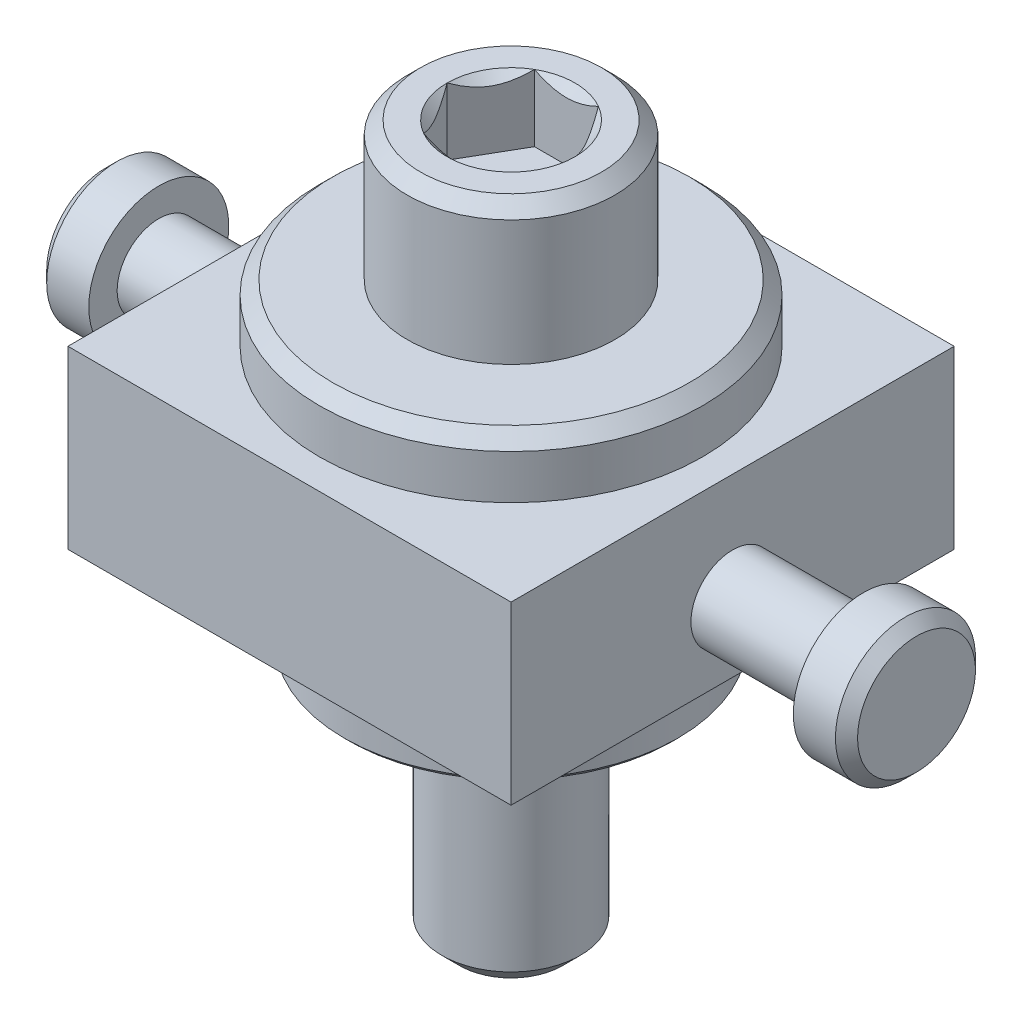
ISO-10303-21;
HEADER;
FILE_DESCRIPTION(('STEP AP214'),'2;1');
FILE_NAME('part.step','',(''),(''),'','','');
FILE_SCHEMA(('AUTOMOTIVE_DESIGN { 1 0 10303 214 1 1 1 1 }'));
ENDSEC;
DATA;
#1=APPLICATION_CONTEXT('core data for automotive mechanical design processes');
#2=APPLICATION_PROTOCOL_DEFINITION('international standard','automotive_design',2000,#1);
#3=PRODUCT_CONTEXT('',#1,'mechanical');
#4=PRODUCT('Part','Part','',(#3));
#5=PRODUCT_RELATED_PRODUCT_CATEGORY('part','',(#4));
#6=PRODUCT_DEFINITION_FORMATION('','',#4);
#7=PRODUCT_DEFINITION_CONTEXT('part definition',#1,'design');
#8=PRODUCT_DEFINITION('design','',#6,#7);
#9=PRODUCT_DEFINITION_SHAPE('','',#8);
#10=(LENGTH_UNIT() NAMED_UNIT(*) SI_UNIT(.MILLI.,.METRE.));
#11=(NAMED_UNIT(*) PLANE_ANGLE_UNIT() SI_UNIT($,.RADIAN.));
#12=(NAMED_UNIT(*) SI_UNIT($,.STERADIAN.) SOLID_ANGLE_UNIT());
#13=UNCERTAINTY_MEASURE_WITH_UNIT(LENGTH_MEASURE(1.E-05),#10,'distance_accuracy_value','');
#14=(GEOMETRIC_REPRESENTATION_CONTEXT(3) GLOBAL_UNCERTAINTY_ASSIGNED_CONTEXT((#13)) GLOBAL_UNIT_ASSIGNED_CONTEXT((#10,
#11,#12)) REPRESENTATION_CONTEXT('',''));
#15=CARTESIAN_POINT('',(0.,0.,0.));
#16=DIRECTION('',(0.,0.,1.));
#17=DIRECTION('',(1.,0.,0.));
#18=AXIS2_PLACEMENT_3D('',#15,#16,#17);
#19=CARTESIAN_POINT('',(12.7,-14.2875,-12.7));
#20=DIRECTION('',(1.,0.,0.));
#21=DIRECTION('',(0.,0.,-1.));
#22=AXIS2_PLACEMENT_3D('',#19,#20,#21);
#23=PLANE('',#22);
#24=DIRECTION('',(0.,1.,0.));
#25=VECTOR('',#24,1.);
#26=CARTESIAN_POINT('',(12.7,-14.2875,-12.7));
#27=LINE('',#26,#25);
#28=CARTESIAN_POINT('',(12.7,4.9022,-12.7));
#29=VERTEX_POINT('',#28);
#30=CARTESIAN_POINT('',(12.7,14.986,-12.7));
#31=VERTEX_POINT('',#30);
#32=EDGE_CURVE('E45',#29,#31,#27,.T.);
#33=ORIENTED_EDGE('',*,*,#32,.T.);
#34=DIRECTION('',(0.,0.,-1.));
#35=VECTOR('',#34,1.);
#36=CARTESIAN_POINT('',(12.7,14.986,-12.7));
#37=LINE('',#36,#35);
#38=CARTESIAN_POINT('',(12.7,14.986,12.7));
#39=VERTEX_POINT('',#38);
#40=EDGE_CURVE('E148',#39,#31,#37,.T.);
#41=ORIENTED_EDGE('',*,*,#40,.F.);
#42=DIRECTION('',(0.,1.,0.));
#43=VECTOR('',#42,1.);
#44=CARTESIAN_POINT('',(12.7,-14.2875,12.7));
#45=LINE('',#44,#43);
#46=CARTESIAN_POINT('',(12.7,4.90219999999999,12.7));
#47=VERTEX_POINT('',#46);
#48=EDGE_CURVE('E175',#47,#39,#45,.T.);
#49=ORIENTED_EDGE('',*,*,#48,.F.);
#50=DIRECTION('',(0.,0.,1.));
#51=VECTOR('',#50,1.);
#52=CARTESIAN_POINT('',(12.7,4.9022,0.));
#53=LINE('',#52,#51);
#54=EDGE_CURVE('E191',#29,#47,#53,.T.);
#55=ORIENTED_EDGE('',*,*,#54,.F.);
#56=EDGE_LOOP('',(#33,#41,#49,#55));
#57=FACE_BOUND('',#56,.T.);
#58=CARTESIAN_POINT('',(12.7,8.83919999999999,0.));
#59=DIRECTION('',(1.,0.,0.));
#60=DIRECTION('',(0.,0.,-1.));
#61=AXIS2_PLACEMENT_3D('',#58,#59,#60);
#62=CIRCLE('',#61,2.3876);
#63=CARTESIAN_POINT('',(12.7,8.83919999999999,-2.3876));
#64=VERTEX_POINT('',#63);
#65=EDGE_CURVE('E128',#64,#64,#62,.F.);
#66=ORIENTED_EDGE('',*,*,#65,.T.);
#67=EDGE_LOOP('',(#66));
#68=FACE_BOUND('',#67,.T.);
#69=ADVANCED_FACE('F29',(#57,#68),#23,.T.);
#70=CARTESIAN_POINT('',(-12.7,-14.2875,-12.7));
#71=DIRECTION('',(-1.,0.,0.));
#72=DIRECTION('',(0.,0.,1.));
#73=AXIS2_PLACEMENT_3D('',#70,#71,#72);
#74=PLANE('',#73);
#75=DIRECTION('',(0.,1.,0.));
#76=VECTOR('',#75,1.);
#77=CARTESIAN_POINT('',(-12.7,-14.2875,12.7));
#78=LINE('',#77,#76);
#79=CARTESIAN_POINT('',(-12.7,4.90219999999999,12.7));
#80=VERTEX_POINT('',#79);
#81=CARTESIAN_POINT('',(-12.7,14.986,12.7));
#82=VERTEX_POINT('',#81);
#83=EDGE_CURVE('E178',#80,#82,#78,.T.);
#84=ORIENTED_EDGE('',*,*,#83,.T.);
#85=DIRECTION('',(0.,0.,1.));
#86=VECTOR('',#85,1.);
#87=CARTESIAN_POINT('',(-12.7,14.986,-12.7));
#88=LINE('',#87,#86);
#89=CARTESIAN_POINT('',(-12.7,14.986,-12.7));
#90=VERTEX_POINT('',#89);
#91=EDGE_CURVE('E53',#90,#82,#88,.T.);
#92=ORIENTED_EDGE('',*,*,#91,.F.);
#93=DIRECTION('',(0.,1.,0.));
#94=VECTOR('',#93,1.);
#95=CARTESIAN_POINT('',(-12.7,-14.2875,-12.7));
#96=LINE('',#95,#94);
#97=CARTESIAN_POINT('',(-12.7,4.90219999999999,-12.7));
#98=VERTEX_POINT('',#97);
#99=EDGE_CURVE('E180',#98,#90,#96,.T.);
#100=ORIENTED_EDGE('',*,*,#99,.F.);
#101=DIRECTION('',(0.,0.,-1.));
#102=VECTOR('',#101,1.);
#103=CARTESIAN_POINT('',(-12.7,4.9022,0.));
#104=LINE('',#103,#102);
#105=EDGE_CURVE('E185',#80,#98,#104,.T.);
#106=ORIENTED_EDGE('',*,*,#105,.F.);
#107=EDGE_LOOP('',(#84,#92,#100,#106));
#108=FACE_BOUND('',#107,.T.);
#109=CARTESIAN_POINT('',(-12.7,8.83919999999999,0.));
#110=DIRECTION('',(-1.,0.,0.));
#111=DIRECTION('',(0.,0.,1.));
#112=AXIS2_PLACEMENT_3D('',#109,#110,#111);
#113=CIRCLE('',#112,2.3876);
#114=CARTESIAN_POINT('',(-12.7,8.83919999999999,2.3876));
#115=VERTEX_POINT('',#114);
#116=EDGE_CURVE('E33',#115,#115,#113,.F.);
#117=ORIENTED_EDGE('',*,*,#116,.T.);
#118=EDGE_LOOP('',(#117));
#119=FACE_BOUND('',#118,.T.);
#120=ADVANCED_FACE('F233',(#108,#119),#74,.T.);
#121=CARTESIAN_POINT('',(9.55675,4.9022,0.));
#122=DIRECTION('',(0.,-1.,0.));
#123=DIRECTION('',(0.,0.,-1.));
#124=AXIS2_PLACEMENT_3D('',#121,#122,#123);
#125=PLANE('',#124);
#126=CARTESIAN_POINT('',(0.,4.9022,0.));
#127=DIRECTION('',(0.,-1.,0.));
#128=DIRECTION('',(0.,0.,-1.));
#129=AXIS2_PLACEMENT_3D('',#126,#127,#128);
#130=CIRCLE('',#129,9.55675);
#131=CARTESIAN_POINT('',(0.,4.9022,-9.55675));
#132=VERTEX_POINT('',#131);
#133=EDGE_CURVE('E38',#132,#132,#130,.T.);
#134=ORIENTED_EDGE('',*,*,#133,.F.);
#135=EDGE_LOOP('',(#134));
#136=FACE_BOUND('',#135,.T.);
#137=DIRECTION('',(1.,0.,0.));
#138=VECTOR('',#137,1.);
#139=CARTESIAN_POINT('',(9.55675,4.9022,-12.7));
#140=LINE('',#139,#138);
#141=EDGE_CURVE('E177',#98,#29,#140,.T.);
#142=ORIENTED_EDGE('',*,*,#141,.T.);
#143=ORIENTED_EDGE('',*,*,#54,.T.);
#144=DIRECTION('',(-1.,0.,0.));
#145=VECTOR('',#144,1.);
#146=CARTESIAN_POINT('',(9.55675,4.9022,12.7));
#147=LINE('',#146,#145);
#148=EDGE_CURVE('E188',#47,#80,#147,.T.);
#149=ORIENTED_EDGE('',*,*,#148,.T.);
#150=ORIENTED_EDGE('',*,*,#105,.T.);
#151=EDGE_LOOP('',(#142,#143,#149,#150));
#152=FACE_BOUND('',#151,.T.);
#153=ADVANCED_FACE('F230',(#136,#152),#125,.T.);
#154=CARTESIAN_POINT('',(0.,0.,0.));
#155=DIRECTION('',(0.,1.,0.));
#156=DIRECTION('',(0.,0.,1.));
#157=AXIS2_PLACEMENT_3D('',#154,#155,#156);
#158=CONICAL_SURFACE('',#157,9.25195,0.785398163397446);
#159=CARTESIAN_POINT('',(0.,0.304799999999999,0.));
#160=DIRECTION('',(0.,-1.,0.));
#161=DIRECTION('',(0.,0.,-1.));
#162=AXIS2_PLACEMENT_3D('',#159,#160,#161);
#163=CIRCLE('',#162,9.55675);
#164=CARTESIAN_POINT('',(0.,0.304799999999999,-9.55675));
#165=VERTEX_POINT('',#164);
#166=EDGE_CURVE('E11',#165,#165,#163,.T.);
#167=ORIENTED_EDGE('',*,*,#166,.T.);
#168=EDGE_LOOP('',(#167));
#169=FACE_BOUND('',#168,.T.);
#170=CARTESIAN_POINT('',(0.,0.,0.));
#171=DIRECTION('',(0.,-1.,0.));
#172=DIRECTION('',(0.,0.,-1.));
#173=AXIS2_PLACEMENT_3D('',#170,#171,#172);
#174=CIRCLE('',#173,9.25195);
#175=CARTESIAN_POINT('',(0.,0.,-9.25195));
#176=VERTEX_POINT('',#175);
#177=EDGE_CURVE('E194',#176,#176,#174,.T.);
#178=ORIENTED_EDGE('',*,*,#177,.F.);
#179=EDGE_LOOP('',(#178));
#180=FACE_BOUND('',#179,.T.);
#181=ADVANCED_FACE('F31',(#169,#180),#158,.T.);
#182=CARTESIAN_POINT('',(0.,-14.2875,0.));
#183=DIRECTION('',(0.,-1.,0.));
#184=DIRECTION('',(0.,0.,-1.));
#185=AXIS2_PLACEMENT_3D('',#182,#183,#184);
#186=CYLINDRICAL_SURFACE('',#185,9.55675);
#187=ORIENTED_EDGE('',*,*,#133,.T.);
#188=EDGE_LOOP('',(#187));
#189=FACE_BOUND('',#188,.T.);
#190=ORIENTED_EDGE('',*,*,#166,.F.);
#191=EDGE_LOOP('',(#190));
#192=FACE_BOUND('',#191,.T.);
#193=ADVANCED_FACE('F227',(#189,#192),#186,.T.);
#194=CARTESIAN_POINT('',(2.95275,-14.2875,0.));
#195=DIRECTION('',(0.,-1.,0.));
#196=DIRECTION('',(0.,0.,-1.));
#197=AXIS2_PLACEMENT_3D('',#194,#195,#196);
#198=PLANE('',#197);
#199=CARTESIAN_POINT('',(0.,-14.2875,0.));
#200=DIRECTION('',(0.,-1.,0.));
#201=DIRECTION('',(0.,0.,-1.));
#202=AXIS2_PLACEMENT_3D('',#199,#200,#201);
#203=CIRCLE('',#202,2.95275);
#204=CARTESIAN_POINT('',(0.,-14.2875,-2.95275));
#205=VERTEX_POINT('',#204);
#206=EDGE_CURVE('E203',#205,#205,#203,.T.);
#207=ORIENTED_EDGE('',*,*,#206,.T.);
#208=EDGE_LOOP('',(#207));
#209=FACE_BOUND('',#208,.T.);
#210=ADVANCED_FACE('F364',(#209),#198,.T.);
#211=CARTESIAN_POINT('',(0.,-14.2875,0.));
#212=DIRECTION('',(0.,1.,0.));
#213=DIRECTION('',(0.,0.,1.));
#214=AXIS2_PLACEMENT_3D('',#211,#212,#213);
#215=CONICAL_SURFACE('',#214,2.95275,0.78539816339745);
#216=CARTESIAN_POINT('',(0.,-13.2715,0.));
#217=DIRECTION('',(0.,-1.,0.));
#218=DIRECTION('',(0.,0.,-1.));
#219=AXIS2_PLACEMENT_3D('',#216,#217,#218);
#220=CIRCLE('',#219,3.96875);
#221=CARTESIAN_POINT('',(0.,-13.2715,-3.96875));
#222=VERTEX_POINT('',#221);
#223=EDGE_CURVE('E200',#222,#222,#220,.T.);
#224=ORIENTED_EDGE('',*,*,#223,.T.);
#225=EDGE_LOOP('',(#224));
#226=FACE_BOUND('',#225,.T.);
#227=ORIENTED_EDGE('',*,*,#206,.F.);
#228=EDGE_LOOP('',(#227));
#229=FACE_BOUND('',#228,.T.);
#230=ADVANCED_FACE('F360',(#226,#229),#215,.T.);
#231=CARTESIAN_POINT('',(0.,-14.2875,0.));
#232=DIRECTION('',(0.,-1.,0.));
#233=DIRECTION('',(0.,0.,-1.));
#234=AXIS2_PLACEMENT_3D('',#231,#232,#233);
#235=CYLINDRICAL_SURFACE('',#234,3.96875);
#236=CARTESIAN_POINT('',(0.,0.,0.));
#237=DIRECTION('',(0.,-1.,0.));
#238=DIRECTION('',(0.,0.,-1.));
#239=AXIS2_PLACEMENT_3D('',#236,#237,#238);
#240=CIRCLE('',#239,3.96875);
#241=CARTESIAN_POINT('',(0.,0.,-3.96875));
#242=VERTEX_POINT('',#241);
#243=EDGE_CURVE('E197',#242,#242,#240,.T.);
#244=ORIENTED_EDGE('',*,*,#243,.T.);
#245=EDGE_LOOP('',(#244));
#246=FACE_BOUND('',#245,.T.);
#247=ORIENTED_EDGE('',*,*,#223,.F.);
#248=EDGE_LOOP('',(#247));
#249=FACE_BOUND('',#248,.T.);
#250=ADVANCED_FACE('F356',(#246,#249),#235,.T.);
#251=CARTESIAN_POINT('',(3.96875,0.,0.));
#252=DIRECTION('',(0.,-1.,0.));
#253=DIRECTION('',(0.,0.,-1.));
#254=AXIS2_PLACEMENT_3D('',#251,#252,#253);
#255=PLANE('',#254);
#256=ORIENTED_EDGE('',*,*,#177,.T.);
#257=EDGE_LOOP('',(#256));
#258=FACE_BOUND('',#257,.T.);
#259=ORIENTED_EDGE('',*,*,#243,.F.);
#260=EDGE_LOOP('',(#259));
#261=FACE_BOUND('',#260,.T.);
#262=ADVANCED_FACE('F353',(#258,#261),#255,.T.);
#263=CARTESIAN_POINT('',(12.7,-14.2875,12.7));
#264=DIRECTION('',(0.,0.,1.));
#265=DIRECTION('',(1.,0.,0.));
#266=AXIS2_PLACEMENT_3D('',#263,#264,#265);
#267=PLANE('',#266);
#268=ORIENTED_EDGE('',*,*,#48,.T.);
#269=DIRECTION('',(1.,0.,0.));
#270=VECTOR('',#269,1.);
#271=CARTESIAN_POINT('',(12.7,14.986,12.7));
#272=LINE('',#271,#270);
#273=EDGE_CURVE('E172',#82,#39,#272,.T.);
#274=ORIENTED_EDGE('',*,*,#273,.F.);
#275=ORIENTED_EDGE('',*,*,#83,.F.);
#276=ORIENTED_EDGE('',*,*,#148,.F.);
#277=EDGE_LOOP('',(#268,#274,#275,#276));
#278=FACE_BOUND('',#277,.T.);
#279=ADVANCED_FACE('F240',(#278),#267,.T.);
#280=CARTESIAN_POINT('',(12.7,-14.2875,-12.7));
#281=DIRECTION('',(0.,0.,-1.));
#282=DIRECTION('',(-1.,0.,0.));
#283=AXIS2_PLACEMENT_3D('',#280,#281,#282);
#284=PLANE('',#283);
#285=ORIENTED_EDGE('',*,*,#99,.T.);
#286=DIRECTION('',(-1.,0.,0.));
#287=VECTOR('',#286,1.);
#288=CARTESIAN_POINT('',(12.7,14.986,-12.7));
#289=LINE('',#288,#287);
#290=EDGE_CURVE('E151',#31,#90,#289,.T.);
#291=ORIENTED_EDGE('',*,*,#290,.F.);
#292=ORIENTED_EDGE('',*,*,#32,.F.);
#293=ORIENTED_EDGE('',*,*,#141,.F.);
#294=EDGE_LOOP('',(#285,#291,#292,#293));
#295=FACE_BOUND('',#294,.T.);
#296=ADVANCED_FACE('F235',(#295),#284,.T.);
#297=CARTESIAN_POINT('',(5.191125,26.2255,0.));
#298=DIRECTION('',(0.,1.,0.));
#299=DIRECTION('',(0.,0.,1.));
#300=AXIS2_PLACEMENT_3D('',#297,#298,#299);
#301=PLANE('',#300);
#302=CARTESIAN_POINT('',(0.,26.2255,0.));
#303=DIRECTION('',(0.,1.,0.));
#304=DIRECTION('',(0.,0.,1.));
#305=AXIS2_PLACEMENT_3D('',#302,#303,#304);
#306=CIRCLE('',#305,3.66617420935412);
#307=CARTESIAN_POINT('',(-1.83308710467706,26.2255,-3.175));
#308=VERTEX_POINT('',#307);
#309=CARTESIAN_POINT('',(-3.66617420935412,26.2255,0.));
#310=VERTEX_POINT('',#309);
#311=EDGE_CURVE('E110',#308,#310,#306,.T.);
#312=ORIENTED_EDGE('',*,*,#311,.F.);
#313=CARTESIAN_POINT('',(0.,26.2255,0.));
#314=DIRECTION('',(0.,1.,0.));
#315=DIRECTION('',(0.,0.,1.));
#316=AXIS2_PLACEMENT_3D('',#313,#314,#315);
#317=CIRCLE('',#316,3.66617420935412);
#318=CARTESIAN_POINT('',(1.83308710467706,26.2255,-3.175));
#319=VERTEX_POINT('',#318);
#320=EDGE_CURVE('E123',#319,#308,#317,.T.);
#321=ORIENTED_EDGE('',*,*,#320,.F.);
#322=CARTESIAN_POINT('',(0.,26.2255,0.));
#323=DIRECTION('',(0.,1.,0.));
#324=DIRECTION('',(0.,0.,1.));
#325=AXIS2_PLACEMENT_3D('',#322,#323,#324);
#326=CIRCLE('',#325,3.66617420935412);
#327=CARTESIAN_POINT('',(3.66617420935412,26.2255,0.));
#328=VERTEX_POINT('',#327);
#329=EDGE_CURVE('E143',#328,#319,#326,.T.);
#330=ORIENTED_EDGE('',*,*,#329,.F.);
#331=CARTESIAN_POINT('',(0.,26.2255,0.));
#332=DIRECTION('',(0.,1.,0.));
#333=DIRECTION('',(0.,0.,1.));
#334=AXIS2_PLACEMENT_3D('',#331,#332,#333);
#335=CIRCLE('',#334,3.66617420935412);
#336=CARTESIAN_POINT('',(1.83308710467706,26.2255,3.175));
#337=VERTEX_POINT('',#336);
#338=EDGE_CURVE('E727',#337,#328,#335,.T.);
#339=ORIENTED_EDGE('',*,*,#338,.F.);
#340=CARTESIAN_POINT('',(0.,26.2255,0.));
#341=DIRECTION('',(0.,1.,0.));
#342=DIRECTION('',(0.,0.,1.));
#343=AXIS2_PLACEMENT_3D('',#340,#341,#342);
#344=CIRCLE('',#343,3.66617420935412);
#345=CARTESIAN_POINT('',(-1.83308710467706,26.2255,3.175));
#346=VERTEX_POINT('',#345);
#347=EDGE_CURVE('E730',#346,#337,#344,.T.);
#348=ORIENTED_EDGE('',*,*,#347,.F.);
#349=CARTESIAN_POINT('',(0.,26.2255,0.));
#350=DIRECTION('',(0.,1.,0.));
#351=DIRECTION('',(0.,0.,1.));
#352=AXIS2_PLACEMENT_3D('',#349,#350,#351);
#353=CIRCLE('',#352,3.66617420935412);
#354=EDGE_CURVE('E126',#310,#346,#353,.T.);
#355=ORIENTED_EDGE('',*,*,#354,.F.);
#356=EDGE_LOOP('',(#312,#321,#330,#339,#348,#355));
#357=FACE_BOUND('',#356,.T.);
#358=CARTESIAN_POINT('',(0.,26.2255,0.));
#359=DIRECTION('',(0.,-1.,0.));
#360=DIRECTION('',(0.,0.,-1.));
#361=AXIS2_PLACEMENT_3D('',#358,#359,#360);
#362=CIRCLE('',#361,5.191125);
#363=CARTESIAN_POINT('',(0.,26.2255,-5.191125));
#364=VERTEX_POINT('',#363);
#365=EDGE_CURVE('E206',#364,#364,#362,.T.);
#366=ORIENTED_EDGE('',*,*,#365,.F.);
#367=EDGE_LOOP('',(#366));
#368=FACE_BOUND('',#367,.T.);
#369=ADVANCED_FACE('F120',(#357,#368),#301,.T.);
#370=CARTESIAN_POINT('',(0.,25.4635,0.));
#371=DIRECTION('',(0.,-1.,0.));
#372=DIRECTION('',(0.,0.,-1.));
#373=AXIS2_PLACEMENT_3D('',#370,#371,#372);
#374=CONICAL_SURFACE('',#373,5.953125,0.785398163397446);
#375=ORIENTED_EDGE('',*,*,#365,.T.);
#376=EDGE_LOOP('',(#375));
#377=FACE_BOUND('',#376,.T.);
#378=CARTESIAN_POINT('',(0.,25.4635,0.));
#379=DIRECTION('',(0.,-1.,0.));
#380=DIRECTION('',(0.,0.,-1.));
#381=AXIS2_PLACEMENT_3D('',#378,#379,#380);
#382=CIRCLE('',#381,5.953125);
#383=CARTESIAN_POINT('',(0.,25.4635,-5.953125));
#384=VERTEX_POINT('',#383);
#385=EDGE_CURVE('E209',#384,#384,#382,.T.);
#386=ORIENTED_EDGE('',*,*,#385,.F.);
#387=EDGE_LOOP('',(#386));
#388=FACE_BOUND('',#387,.T.);
#389=ADVANCED_FACE('F371',(#377,#388),#374,.T.);
#390=CARTESIAN_POINT('',(0.,-14.2875,0.));
#391=DIRECTION('',(0.,-1.,0.));
#392=DIRECTION('',(0.,0.,-1.));
#393=AXIS2_PLACEMENT_3D('',#390,#391,#392);
#394=CYLINDRICAL_SURFACE('',#393,5.953125);
#395=ORIENTED_EDGE('',*,*,#385,.T.);
#396=EDGE_LOOP('',(#395));
#397=FACE_BOUND('',#396,.T.);
#398=CARTESIAN_POINT('',(0.,18.288,0.));
#399=DIRECTION('',(0.,-1.,0.));
#400=DIRECTION('',(0.,0.,-1.));
#401=AXIS2_PLACEMENT_3D('',#398,#399,#400);
#402=CIRCLE('',#401,5.953125);
#403=CARTESIAN_POINT('',(0.,18.288,-5.953125));
#404=VERTEX_POINT('',#403);
#405=EDGE_CURVE('E212',#404,#404,#402,.T.);
#406=ORIENTED_EDGE('',*,*,#405,.F.);
#407=EDGE_LOOP('',(#406));
#408=FACE_BOUND('',#407,.T.);
#409=ADVANCED_FACE('F374',(#397,#408),#394,.T.);
#410=CARTESIAN_POINT('',(10.2235,18.288,0.));
#411=DIRECTION('',(0.,1.,0.));
#412=DIRECTION('',(0.,0.,1.));
#413=AXIS2_PLACEMENT_3D('',#410,#411,#412);
#414=PLANE('',#413);
#415=ORIENTED_EDGE('',*,*,#405,.T.);
#416=EDGE_LOOP('',(#415));
#417=FACE_BOUND('',#416,.T.);
#418=CARTESIAN_POINT('',(0.,18.288,0.));
#419=DIRECTION('',(0.,-1.,0.));
#420=DIRECTION('',(0.,0.,-1.));
#421=AXIS2_PLACEMENT_3D('',#418,#419,#420);
#422=CIRCLE('',#421,10.2235);
#423=CARTESIAN_POINT('',(0.,18.288,-10.2235));
#424=VERTEX_POINT('',#423);
#425=EDGE_CURVE('E215',#424,#424,#422,.T.);
#426=ORIENTED_EDGE('',*,*,#425,.F.);
#427=EDGE_LOOP('',(#426));
#428=FACE_BOUND('',#427,.T.);
#429=ADVANCED_FACE('F378',(#417,#428),#414,.T.);
#430=CARTESIAN_POINT('',(0.,17.526,0.));
#431=DIRECTION('',(0.,-1.,0.));
#432=DIRECTION('',(0.,0.,-1.));
#433=AXIS2_PLACEMENT_3D('',#430,#431,#432);
#434=CONICAL_SURFACE('',#433,10.9855,0.785398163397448);
#435=ORIENTED_EDGE('',*,*,#425,.T.);
#436=EDGE_LOOP('',(#435));
#437=FACE_BOUND('',#436,.T.);
#438=CARTESIAN_POINT('',(0.,17.526,0.));
#439=DIRECTION('',(0.,-1.,0.));
#440=DIRECTION('',(0.,0.,-1.));
#441=AXIS2_PLACEMENT_3D('',#438,#439,#440);
#442=CIRCLE('',#441,10.9855);
#443=CARTESIAN_POINT('',(0.,17.526,-10.9855));
#444=VERTEX_POINT('',#443);
#445=EDGE_CURVE('E218',#444,#444,#442,.T.);
#446=ORIENTED_EDGE('',*,*,#445,.F.);
#447=EDGE_LOOP('',(#446));
#448=FACE_BOUND('',#447,.T.);
#449=ADVANCED_FACE('F382',(#437,#448),#434,.T.);
#450=CARTESIAN_POINT('',(0.,-14.2875,0.));
#451=DIRECTION('',(0.,-1.,0.));
#452=DIRECTION('',(0.,0.,-1.));
#453=AXIS2_PLACEMENT_3D('',#450,#451,#452);
#454=CYLINDRICAL_SURFACE('',#453,10.9855);
#455=ORIENTED_EDGE('',*,*,#445,.T.);
#456=EDGE_LOOP('',(#455));
#457=FACE_BOUND('',#456,.T.);
#458=CARTESIAN_POINT('',(0.,14.986,0.));
#459=DIRECTION('',(0.,-1.,0.));
#460=DIRECTION('',(0.,0.,-1.));
#461=AXIS2_PLACEMENT_3D('',#458,#459,#460);
#462=CIRCLE('',#461,10.9855);
#463=CARTESIAN_POINT('',(0.,14.986,-10.9855));
#464=VERTEX_POINT('',#463);
#465=EDGE_CURVE('E221',#464,#464,#462,.T.);
#466=ORIENTED_EDGE('',*,*,#465,.F.);
#467=EDGE_LOOP('',(#466));
#468=FACE_BOUND('',#467,.T.);
#469=ADVANCED_FACE('F386',(#457,#468),#454,.T.);
#470=CARTESIAN_POINT('',(18.7452,14.986,0.));
#471=DIRECTION('',(0.,1.,0.));
#472=DIRECTION('',(0.,0.,1.));
#473=AXIS2_PLACEMENT_3D('',#470,#471,#472);
#474=PLANE('',#473);
#475=ORIENTED_EDGE('',*,*,#465,.T.);
#476=EDGE_LOOP('',(#475));
#477=FACE_BOUND('',#476,.T.);
#478=ORIENTED_EDGE('',*,*,#273,.T.);
#479=ORIENTED_EDGE('',*,*,#40,.T.);
#480=ORIENTED_EDGE('',*,*,#290,.T.);
#481=ORIENTED_EDGE('',*,*,#91,.T.);
#482=EDGE_LOOP('',(#478,#479,#480,#481));
#483=FACE_BOUND('',#482,.T.);
#484=ADVANCED_FACE('F244',(#477,#483),#474,.T.);
#485=CARTESIAN_POINT('',(-1.83308710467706,22.3901,-3.175));
#486=DIRECTION('',(-0.866025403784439,0.,-0.5));
#487=DIRECTION('',(-0.5,0.,0.866025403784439));
#488=AXIS2_PLACEMENT_3D('',#485,#486,#487);
#489=PLANE('',#488);
#490=DIRECTION('',(0.,1.,0.));
#491=VECTOR('',#490,1.);
#492=CARTESIAN_POINT('',(-1.83308710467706,22.3901,-3.175));
#493=LINE('',#492,#491);
#494=CARTESIAN_POINT('',(-1.83308710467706,22.3901,-3.175));
#495=VERTEX_POINT('',#494);
#496=EDGE_CURVE('E140',#495,#308,#493,.T.);
#497=ORIENTED_EDGE('',*,*,#496,.T.);
#498=CARTESIAN_POINT('',(-3.66628967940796,26.2256154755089,0.000200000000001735));
#499=CARTESIAN_POINT('',(-3.60327862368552,26.1626589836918,-0.108938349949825));
#500=CARTESIAN_POINT('',(-3.53921394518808,26.1034001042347,-0.219901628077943));
#501=CARTESIAN_POINT('',(-3.40857908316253,25.9948986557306,-0.446167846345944));
#502=CARTESIAN_POINT('',(-3.34199647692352,25.9457164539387,-0.56149230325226));
#503=CARTESIAN_POINT('',(-3.207735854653,25.861466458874,-0.794038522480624));
#504=CARTESIAN_POINT('',(-3.14009202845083,25.8261869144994,-0.911201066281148));
#505=CARTESIAN_POINT('',(-3.00331522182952,25.7718315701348,-1.14810544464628));
#506=CARTESIAN_POINT('',(-2.93418641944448,25.7527151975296,-1.26784004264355));
#507=CARTESIAN_POINT('',(-2.81504564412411,25.7354671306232,-1.47419791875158));
#508=CARTESIAN_POINT('',(-2.76518752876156,25.7329139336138,-1.56055470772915));
#509=CARTESIAN_POINT('',(-2.66555239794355,25.7372162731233,-1.73312781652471));
#510=CARTESIAN_POINT('',(-2.61577541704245,25.7440751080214,-1.8193440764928));
#511=CARTESIAN_POINT('',(-2.51669303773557,25.7668098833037,-1.99095979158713));
#512=CARTESIAN_POINT('',(-2.4673882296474,25.7826959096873,-2.07635822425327));
#513=CARTESIAN_POINT('',(-2.36962540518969,25.822617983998,-2.24568840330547));
#514=CARTESIAN_POINT('',(-2.32116732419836,25.8466534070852,-2.32962026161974));
#515=CARTESIAN_POINT('',(-2.23514021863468,25.8961052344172,-2.47862357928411));
#516=CARTESIAN_POINT('',(-2.19738077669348,25.920221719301,-2.54402485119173));
#517=CARTESIAN_POINT('',(-2.12253978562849,25.9723414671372,-2.6736532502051));
#518=CARTESIAN_POINT('',(-2.08545825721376,26.0003448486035,-2.73788034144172));
#519=CARTESIAN_POINT('',(-2.01208991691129,26.0596105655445,-2.8649580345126));
#520=CARTESIAN_POINT('',(-1.97580101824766,26.0908626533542,-2.92781225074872));
#521=CARTESIAN_POINT('',(-1.90389529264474,26.1562153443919,-3.05235662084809));
#522=CARTESIAN_POINT('',(-1.86827806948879,26.1903141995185,-3.11404746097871));
#523=CARTESIAN_POINT('',(-1.83297163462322,26.2256154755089,-3.1752));
#524=B_SPLINE_CURVE_WITH_KNOTS('',3,(#498,#499,#500,#501,#502,#503,#504,#505,#506,#507,#508,
#509,#510,#511,#512,#513,#514,#515,#516,#517,#518,#519,#520,#521,#522,#523),.UNSPECIFIED.,.F.,
.F.,(4,2,2,2,2,2,2,2,2,2,2,2,4),(0.,0.422910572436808,0.848285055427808,1.26690402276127,
1.68446903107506,1.98329272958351,2.2822211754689,2.58148426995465,2.88072442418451,
3.11844134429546,3.35616551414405,3.59316134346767,3.8300126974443),.UNSPECIFIED.);
#525=EDGE_CURVE('E107',#310,#308,#524,.T.);
#526=ORIENTED_EDGE('',*,*,#525,.F.);
#527=DIRECTION('',(0.,1.,0.));
#528=VECTOR('',#527,1.);
#529=CARTESIAN_POINT('',(-3.66617420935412,22.3901,0.));
#530=LINE('',#529,#528);
#531=CARTESIAN_POINT('',(-3.66617420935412,22.3901,0.));
#532=VERTEX_POINT('',#531);
#533=EDGE_CURVE('E167',#532,#310,#530,.T.);
#534=ORIENTED_EDGE('',*,*,#533,.F.);
#535=DIRECTION('',(-0.5,0.,0.866025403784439));
#536=VECTOR('',#535,1.);
#537=CARTESIAN_POINT('',(-1.83308710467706,22.3901,-3.175));
#538=LINE('',#537,#536);
#539=EDGE_CURVE('E135',#495,#532,#538,.T.);
#540=ORIENTED_EDGE('',*,*,#539,.F.);
#541=EDGE_LOOP('',(#497,#526,#534,#540));
#542=FACE_BOUND('',#541,.T.);
#543=ADVANCED_FACE('F145',(#542),#489,.F.);
#544=CARTESIAN_POINT('',(1.83308710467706,22.3901,-3.175));
#545=DIRECTION('',(0.,0.,-1.));
#546=DIRECTION('',(-1.,0.,0.));
#547=AXIS2_PLACEMENT_3D('',#544,#545,#546);
#548=PLANE('',#547);
#549=DIRECTION('',(0.,1.,0.));
#550=VECTOR('',#549,1.);
#551=CARTESIAN_POINT('',(1.83308710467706,22.3901,-3.175));
#552=LINE('',#551,#550);
#553=CARTESIAN_POINT('',(1.83308710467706,22.3901,-3.175));
#554=VERTEX_POINT('',#553);
#555=EDGE_CURVE('E142',#554,#319,#552,.T.);
#556=ORIENTED_EDGE('',*,*,#555,.T.);
#557=CARTESIAN_POINT('',(-3.65592387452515,27.4014745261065,-3.175));
#558=CARTESIAN_POINT('',(-3.56690614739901,27.334279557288,-3.175));
#559=CARTESIAN_POINT('',(-3.47739001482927,27.2677341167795,-3.175));
#560=CARTESIAN_POINT('',(-3.29716433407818,27.136233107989,-3.175));
#561=CARTESIAN_POINT('',(-3.20645449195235,27.0712779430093,-3.175));
#562=CARTESIAN_POINT('',(-3.02298124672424,26.9427864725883,-3.175));
#563=CARTESIAN_POINT('',(-2.93020737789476,26.8792650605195,-3.175));
#564=CARTESIAN_POINT('',(-2.74308490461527,26.7545932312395,-3.175));
#565=CARTESIAN_POINT('',(-2.64873641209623,26.693442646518,-3.175));
#566=CARTESIAN_POINT('',(-2.45276910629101,26.5706272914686,-3.175));
#567=CARTESIAN_POINT('',(-2.35104296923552,26.5091329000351,-3.175));
#568=CARTESIAN_POINT('',(-2.14521620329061,26.3901900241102,-3.175));
#569=CARTESIAN_POINT('',(-2.04111520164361,26.3327421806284,-3.175));
#570=CARTESIAN_POINT('',(-1.8305483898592,26.2231319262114,-3.175));
#571=CARTESIAN_POINT('',(-1.72409073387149,26.1709539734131,-3.175));
#572=CARTESIAN_POINT('',(-1.50827203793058,26.0730515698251,-3.175));
#573=CARTESIAN_POINT('',(-1.39891233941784,26.0273241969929,-3.175));
#574=CARTESIAN_POINT('',(-1.18604701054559,25.9473061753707,-3.175));
#575=CARTESIAN_POINT('',(-1.08277848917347,25.9123913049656,-3.175));
#576=CARTESIAN_POINT('',(-0.873755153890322,25.8508463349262,-3.175));
#577=CARTESIAN_POINT('',(-0.768000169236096,25.8242168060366,-3.175));
#578=CARTESIAN_POINT('',(-0.556394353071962,25.7810761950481,-3.175));
#579=CARTESIAN_POINT('',(-0.450579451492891,25.7643917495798,-3.175));
#580=CARTESIAN_POINT('',(-0.237818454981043,25.741465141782,-3.175));
#581=CARTESIAN_POINT('',(-0.130872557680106,25.7352211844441,-3.175));
#582=CARTESIAN_POINT('',(0.0792250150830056,25.7336392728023,-3.175));
#583=CARTESIAN_POINT('',(0.18237391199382,25.737914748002,-3.175));
#584=CARTESIAN_POINT('',(0.387788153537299,25.7562826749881,-3.175));
#585=CARTESIAN_POINT('',(0.490053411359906,25.7703760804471,-3.175));
#586=CARTESIAN_POINT('',(0.694689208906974,25.8078506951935,-3.175));
#587=CARTESIAN_POINT('',(0.797030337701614,25.8313899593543,-3.175));
#588=CARTESIAN_POINT('',(0.999482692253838,25.8865009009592,-3.175));
#589=CARTESIAN_POINT('',(1.09959410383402,25.9180719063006,-3.175));
#590=CARTESIAN_POINT('',(1.30666025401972,25.9911970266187,-3.175));
#591=CARTESIAN_POINT('',(1.41338058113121,26.0334082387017,-3.175));
#592=CARTESIAN_POINT('',(1.6240351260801,26.1243053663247,-3.175));
#593=CARTESIAN_POINT('',(1.72796839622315,26.1729934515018,-3.175));
#594=CARTESIAN_POINT('',(1.93357808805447,26.2756937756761,-3.175));
#595=CARTESIAN_POINT('',(2.03524592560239,26.3297230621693,-3.175));
#596=CARTESIAN_POINT('',(2.23624195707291,26.4419089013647,-3.175));
#597=CARTESIAN_POINT('',(2.3355705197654,26.5000647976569,-3.175));
#598=CARTESIAN_POINT('',(2.52730642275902,26.6167151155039,-3.175));
#599=CARTESIAN_POINT('',(2.61981218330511,26.6750486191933,-3.175));
#600=CARTESIAN_POINT('',(2.80323560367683,26.7941686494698,-3.175));
#601=CARTESIAN_POINT('',(2.89415314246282,26.8549553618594,-3.175));
#602=CARTESIAN_POINT('',(3.07387072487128,26.9780412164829,-3.175));
#603=CARTESIAN_POINT('',(3.16268196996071,27.0403240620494,-3.175));
#604=CARTESIAN_POINT('',(3.33909075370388,27.1665368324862,-3.175));
#605=CARTESIAN_POINT('',(3.42668861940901,27.2304662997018,-3.175));
#606=CARTESIAN_POINT('',(3.51377838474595,27.2950689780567,-3.175));
#607=B_SPLINE_CURVE_WITH_KNOTS('',3,(#557,#558,#559,#560,#561,#562,#563,#564,#565,#566,#567,
#568,#569,#570,#571,#572,#573,#574,#575,#576,#577,#578,#579,#580,#581,#582,#583,#584,#585,#586,
#587,#588,#589,#590,#591,#592,#593,#594,#595,#596,#597,#598,#599,#600,#601,#602,#603,#604,#605,
#606),.UNSPECIFIED.,.F.,.F.,(4,2,2,2,2,2,2,2,2,2,2,2,2,2,2,2,2,2,2,2,2,2,2,2,4),(0.,
0.334601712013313,0.669287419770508,1.00656636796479,1.34382144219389,1.70035269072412,
2.05694029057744,2.41244349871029,2.76778514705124,3.09453137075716,3.42130009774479,
3.74219200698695,4.06302874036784,4.37225254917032,4.6815063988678,4.99616636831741,
5.31080001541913,5.65482708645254,5.99896969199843,6.34424851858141,6.68947254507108,
7.01751396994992,7.3455802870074,7.670981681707,7.99629359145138),.UNSPECIFIED.);
#608=EDGE_CURVE('E134',#308,#319,#607,.T.);
#609=ORIENTED_EDGE('',*,*,#608,.F.);
#610=ORIENTED_EDGE('',*,*,#496,.F.);
#611=DIRECTION('',(-1.,0.,0.));
#612=VECTOR('',#611,1.);
#613=CARTESIAN_POINT('',(1.83308710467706,22.3901,-3.175));
#614=LINE('',#613,#612);
#615=EDGE_CURVE('E156',#554,#495,#614,.T.);
#616=ORIENTED_EDGE('',*,*,#615,.F.);
#617=EDGE_LOOP('',(#556,#609,#610,#616));
#618=FACE_BOUND('',#617,.T.);
#619=ADVANCED_FACE('F138',(#618),#548,.F.);
#620=CARTESIAN_POINT('',(3.66617420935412,22.3901,0.));
#621=DIRECTION('',(0.866025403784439,0.,-0.5));
#622=DIRECTION('',(-0.5,0.,-0.866025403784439));
#623=AXIS2_PLACEMENT_3D('',#620,#621,#622);
#624=PLANE('',#623);
#625=DIRECTION('',(0.,1.,0.));
#626=VECTOR('',#625,1.);
#627=CARTESIAN_POINT('',(3.66617420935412,22.3901,0.));
#628=LINE('',#627,#626);
#629=CARTESIAN_POINT('',(3.66617420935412,22.3901,0.));
#630=VERTEX_POINT('',#629);
#631=EDGE_CURVE('E153',#630,#328,#628,.T.);
#632=ORIENTED_EDGE('',*,*,#631,.T.);
#633=CARTESIAN_POINT('',(1.83297163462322,26.2256154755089,-3.1752));
#634=CARTESIAN_POINT('',(1.89598269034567,26.1626589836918,-3.06606165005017));
#635=CARTESIAN_POINT('',(1.9600473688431,26.1034001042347,-2.95509837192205));
#636=CARTESIAN_POINT('',(2.09068223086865,25.9948986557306,-2.72883215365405));
#637=CARTESIAN_POINT('',(2.15726483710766,25.9457164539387,-2.61350769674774));
#638=CARTESIAN_POINT('',(2.29152545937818,25.861466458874,-2.38096147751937));
#639=CARTESIAN_POINT('',(2.35916928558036,25.8261869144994,-2.26379893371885));
#640=CARTESIAN_POINT('',(2.49594609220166,25.7718315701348,-2.02689455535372));
#641=CARTESIAN_POINT('',(2.5650748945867,25.7527151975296,-1.90715995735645));
#642=CARTESIAN_POINT('',(2.68421566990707,25.7354671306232,-1.70080208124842));
#643=CARTESIAN_POINT('',(2.73407378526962,25.7329139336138,-1.61444529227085));
#644=CARTESIAN_POINT('',(2.83370891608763,25.7372162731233,-1.44187218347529));
#645=CARTESIAN_POINT('',(2.88348589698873,25.7440751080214,-1.3556559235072));
#646=CARTESIAN_POINT('',(2.98256827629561,25.7668098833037,-1.18404020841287));
#647=CARTESIAN_POINT('',(3.03187308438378,25.7826959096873,-1.09864177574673));
#648=CARTESIAN_POINT('',(3.12963590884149,25.822617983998,-0.929311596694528));
#649=CARTESIAN_POINT('',(3.17809398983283,25.8466534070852,-0.845379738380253));
#650=CARTESIAN_POINT('',(3.2641210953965,25.8961052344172,-0.696376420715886));
#651=CARTESIAN_POINT('',(3.3018805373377,25.920221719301,-0.630975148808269));
#652=CARTESIAN_POINT('',(3.37672152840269,25.9723414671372,-0.501346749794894));
#653=CARTESIAN_POINT('',(3.41380305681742,26.0003448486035,-0.437119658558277));
#654=CARTESIAN_POINT('',(3.48717139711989,26.0596105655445,-0.310041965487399));
#655=CARTESIAN_POINT('',(3.52346029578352,26.0908626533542,-0.247187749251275));
#656=CARTESIAN_POINT('',(3.59536602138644,26.1562153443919,-0.122643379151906));
#657=CARTESIAN_POINT('',(3.63098324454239,26.1903141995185,-0.0609525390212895));
#658=CARTESIAN_POINT('',(3.66628967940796,26.2256154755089,0.000200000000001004));
#659=B_SPLINE_CURVE_WITH_KNOTS('',3,(#633,#634,#635,#636,#637,#638,#639,#640,#641,#642,#643,
#644,#645,#646,#647,#648,#649,#650,#651,#652,#653,#654,#655,#656,#657,#658),.UNSPECIFIED.,.F.,
.F.,(4,2,2,2,2,2,2,2,2,2,2,2,4),(0.,0.422910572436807,0.848285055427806,1.26690402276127,
1.68446903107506,1.98329272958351,2.2822211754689,2.58148426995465,2.88072442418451,
3.11844134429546,3.35616551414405,3.59316134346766,3.8300126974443),.UNSPECIFIED.);
#660=EDGE_CURVE('E697',#319,#328,#659,.T.);
#661=ORIENTED_EDGE('',*,*,#660,.F.);
#662=ORIENTED_EDGE('',*,*,#555,.F.);
#663=DIRECTION('',(-0.5,0.,-0.866025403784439));
#664=VECTOR('',#663,1.);
#665=CARTESIAN_POINT('',(3.66617420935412,22.3901,0.));
#666=LINE('',#665,#664);
#667=EDGE_CURVE('E712',#630,#554,#666,.T.);
#668=ORIENTED_EDGE('',*,*,#667,.F.);
#669=EDGE_LOOP('',(#632,#661,#662,#668));
#670=FACE_BOUND('',#669,.T.);
#671=ADVANCED_FACE('F558',(#670),#624,.F.);
#672=CARTESIAN_POINT('',(1.83308710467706,22.3901,3.175));
#673=DIRECTION('',(0.866025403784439,0.,0.5));
#674=DIRECTION('',(0.5,0.,-0.866025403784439));
#675=AXIS2_PLACEMENT_3D('',#672,#673,#674);
#676=PLANE('',#675);
#677=DIRECTION('',(0.,1.,0.));
#678=VECTOR('',#677,1.);
#679=CARTESIAN_POINT('',(1.83308710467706,22.3901,3.175));
#680=LINE('',#679,#678);
#681=CARTESIAN_POINT('',(1.83308710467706,22.3901,3.175));
#682=VERTEX_POINT('',#681);
#683=EDGE_CURVE('E161',#682,#337,#680,.T.);
#684=ORIENTED_EDGE('',*,*,#683,.T.);
#685=CARTESIAN_POINT('',(3.66628967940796,26.2256154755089,-0.000199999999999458));
#686=CARTESIAN_POINT('',(3.60327862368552,26.1626589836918,0.108938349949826));
#687=CARTESIAN_POINT('',(3.53921394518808,26.1034001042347,0.219901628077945));
#688=CARTESIAN_POINT('',(3.40857908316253,25.9948986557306,0.446167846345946));
#689=CARTESIAN_POINT('',(3.34199647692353,25.9457164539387,0.561492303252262));
#690=CARTESIAN_POINT('',(3.207735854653,25.861466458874,0.794038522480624));
#691=CARTESIAN_POINT('',(3.14009202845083,25.8261869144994,0.911201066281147));
#692=CARTESIAN_POINT('',(3.00331522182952,25.7718315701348,1.14810544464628));
#693=CARTESIAN_POINT('',(2.93418641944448,25.7527151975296,1.26784004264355));
#694=CARTESIAN_POINT('',(2.81504564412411,25.7354671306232,1.47419791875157));
#695=CARTESIAN_POINT('',(2.76518752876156,25.7329139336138,1.56055470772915));
#696=CARTESIAN_POINT('',(2.66555239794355,25.7372162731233,1.73312781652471));
#697=CARTESIAN_POINT('',(2.61577541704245,25.7440751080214,1.8193440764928));
#698=CARTESIAN_POINT('',(2.51669303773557,25.7668098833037,1.99095979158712));
#699=CARTESIAN_POINT('',(2.4673882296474,25.7826959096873,2.07635822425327));
#700=CARTESIAN_POINT('',(2.36962540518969,25.822617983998,2.24568840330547));
#701=CARTESIAN_POINT('',(2.32116732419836,25.8466534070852,2.32962026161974));
#702=CARTESIAN_POINT('',(2.23514021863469,25.8961052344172,2.47862357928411));
#703=CARTESIAN_POINT('',(2.19738077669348,25.920221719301,2.54402485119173));
#704=CARTESIAN_POINT('',(2.12253978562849,25.9723414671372,2.6736532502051));
#705=CARTESIAN_POINT('',(2.08545825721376,26.0003448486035,2.73788034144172));
#706=CARTESIAN_POINT('',(2.01208991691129,26.0596105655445,2.8649580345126));
#707=CARTESIAN_POINT('',(1.97580101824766,26.0908626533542,2.92781225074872));
#708=CARTESIAN_POINT('',(1.90389529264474,26.1562153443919,3.05235662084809));
#709=CARTESIAN_POINT('',(1.86827806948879,26.1903141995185,3.11404746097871));
#710=CARTESIAN_POINT('',(1.83297163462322,26.2256154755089,3.1752));
#711=B_SPLINE_CURVE_WITH_KNOTS('',3,(#685,#686,#687,#688,#689,#690,#691,#692,#693,#694,#695,
#696,#697,#698,#699,#700,#701,#702,#703,#704,#705,#706,#707,#708,#709,#710),.UNSPECIFIED.,.F.,
.F.,(4,2,2,2,2,2,2,2,2,2,2,2,4),(0.,0.422910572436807,0.848285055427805,1.26690402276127,
1.68446903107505,1.98329272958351,2.28222117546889,2.58148426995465,2.88072442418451,
3.11844134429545,3.35616551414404,3.59316134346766,3.83001269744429),.UNSPECIFIED.);
#712=EDGE_CURVE('E724',#328,#337,#711,.T.);
#713=ORIENTED_EDGE('',*,*,#712,.F.);
#714=ORIENTED_EDGE('',*,*,#631,.F.);
#715=DIRECTION('',(0.5,0.,-0.866025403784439));
#716=VECTOR('',#715,1.);
#717=CARTESIAN_POINT('',(1.83308710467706,22.3901,3.175));
#718=LINE('',#717,#716);
#719=EDGE_CURVE('E710',#682,#630,#718,.T.);
#720=ORIENTED_EDGE('',*,*,#719,.F.);
#721=EDGE_LOOP('',(#684,#713,#714,#720));
#722=FACE_BOUND('',#721,.T.);
#723=ADVANCED_FACE('F550',(#722),#676,.F.);
#724=CARTESIAN_POINT('',(-1.83308710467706,22.3901,3.175));
#725=DIRECTION('',(0.,0.,1.));
#726=DIRECTION('',(1.,0.,0.));
#727=AXIS2_PLACEMENT_3D('',#724,#725,#726);
#728=PLANE('',#727);
#729=DIRECTION('',(0.,1.,0.));
#730=VECTOR('',#729,1.);
#731=CARTESIAN_POINT('',(-1.83308710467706,22.3901,3.175));
#732=LINE('',#731,#730);
#733=CARTESIAN_POINT('',(-1.83308710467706,22.3901,3.175));
#734=VERTEX_POINT('',#733);
#735=EDGE_CURVE('E164',#734,#346,#732,.T.);
#736=ORIENTED_EDGE('',*,*,#735,.T.);
#737=CARTESIAN_POINT('',(-3.65592387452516,27.4014745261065,3.175));
#738=CARTESIAN_POINT('',(-3.56690614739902,27.334279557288,3.175));
#739=CARTESIAN_POINT('',(-3.47739001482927,27.2677341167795,3.175));
#740=CARTESIAN_POINT('',(-3.29716433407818,27.136233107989,3.175));
#741=CARTESIAN_POINT('',(-3.20645449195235,27.0712779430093,3.175));
#742=CARTESIAN_POINT('',(-3.02298124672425,26.9427864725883,3.175));
#743=CARTESIAN_POINT('',(-2.93020737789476,26.8792650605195,3.175));
#744=CARTESIAN_POINT('',(-2.74308490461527,26.7545932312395,3.175));
#745=CARTESIAN_POINT('',(-2.64873641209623,26.693442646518,3.175));
#746=CARTESIAN_POINT('',(-2.45276910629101,26.5706272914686,3.175));
#747=CARTESIAN_POINT('',(-2.35104296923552,26.5091329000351,3.175));
#748=CARTESIAN_POINT('',(-2.14521620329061,26.3901900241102,3.175));
#749=CARTESIAN_POINT('',(-2.04111520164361,26.3327421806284,3.175));
#750=CARTESIAN_POINT('',(-1.8305483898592,26.2231319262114,3.175));
#751=CARTESIAN_POINT('',(-1.72409073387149,26.1709539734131,3.175));
#752=CARTESIAN_POINT('',(-1.50827203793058,26.0730515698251,3.175));
#753=CARTESIAN_POINT('',(-1.39891233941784,26.0273241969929,3.175));
#754=CARTESIAN_POINT('',(-1.18604701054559,25.9473061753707,3.175));
#755=CARTESIAN_POINT('',(-1.08277848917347,25.9123913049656,3.175));
#756=CARTESIAN_POINT('',(-0.873755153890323,25.8508463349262,3.175));
#757=CARTESIAN_POINT('',(-0.768000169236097,25.8242168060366,3.175));
#758=CARTESIAN_POINT('',(-0.556394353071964,25.7810761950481,3.175));
#759=CARTESIAN_POINT('',(-0.450579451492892,25.7643917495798,3.175));
#760=CARTESIAN_POINT('',(-0.237818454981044,25.741465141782,3.175));
#761=CARTESIAN_POINT('',(-0.130872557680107,25.7352211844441,3.175));
#762=CARTESIAN_POINT('',(0.0792250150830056,25.7336392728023,3.175));
#763=CARTESIAN_POINT('',(0.182373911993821,25.737914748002,3.175));
#764=CARTESIAN_POINT('',(0.3877881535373,25.7562826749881,3.175));
#765=CARTESIAN_POINT('',(0.490053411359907,25.7703760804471,3.175));
#766=CARTESIAN_POINT('',(0.694689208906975,25.8078506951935,3.175));
#767=CARTESIAN_POINT('',(0.797030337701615,25.8313899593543,3.175));
#768=CARTESIAN_POINT('',(0.999482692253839,25.8865009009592,3.175));
#769=CARTESIAN_POINT('',(1.09959410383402,25.9180719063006,3.175));
#770=CARTESIAN_POINT('',(1.30666025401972,25.9911970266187,3.175));
#771=CARTESIAN_POINT('',(1.41338058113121,26.0334082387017,3.175));
#772=CARTESIAN_POINT('',(1.62403512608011,26.1243053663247,3.175));
#773=CARTESIAN_POINT('',(1.72796839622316,26.1729934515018,3.175));
#774=CARTESIAN_POINT('',(1.93357808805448,26.2756937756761,3.175));
#775=CARTESIAN_POINT('',(2.03524592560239,26.3297230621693,3.175));
#776=CARTESIAN_POINT('',(2.23624195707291,26.4419089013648,3.175));
#777=CARTESIAN_POINT('',(2.3355705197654,26.5000647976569,3.175));
#778=CARTESIAN_POINT('',(2.52730642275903,26.6167151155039,3.175));
#779=CARTESIAN_POINT('',(2.61981218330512,26.6750486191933,3.175));
#780=CARTESIAN_POINT('',(2.80323560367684,26.7941686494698,3.175));
#781=CARTESIAN_POINT('',(2.89415314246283,26.8549553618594,3.175));
#782=CARTESIAN_POINT('',(3.07387072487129,26.9780412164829,3.175));
#783=CARTESIAN_POINT('',(3.16268196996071,27.0403240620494,3.175));
#784=CARTESIAN_POINT('',(3.33909075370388,27.1665368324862,3.175));
#785=CARTESIAN_POINT('',(3.42668861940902,27.2304662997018,3.175));
#786=CARTESIAN_POINT('',(3.51377838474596,27.2950689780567,3.175));
#787=B_SPLINE_CURVE_WITH_KNOTS('',3,(#737,#738,#739,#740,#741,#742,#743,#744,#745,#746,#747,
#748,#749,#750,#751,#752,#753,#754,#755,#756,#757,#758,#759,#760,#761,#762,#763,#764,#765,#766,
#767,#768,#769,#770,#771,#772,#773,#774,#775,#776,#777,#778,#779,#780,#781,#782,#783,#784,#785,
#786),.UNSPECIFIED.,.F.,.F.,(4,2,2,2,2,2,2,2,2,2,2,2,2,2,2,2,2,2,2,2,2,2,2,2,4),(0.,
0.334601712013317,0.669287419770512,1.00656636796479,1.3438214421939,1.70035269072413,
2.05694029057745,2.41244349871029,2.76778514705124,3.09453137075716,3.42130009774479,
3.74219200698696,4.06302874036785,4.37225254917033,4.68150639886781,4.99616636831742,
5.31080001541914,5.65482708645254,5.99896969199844,6.34424851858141,6.68947254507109,
7.01751396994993,7.34558028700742,7.67098168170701,7.99629359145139),.UNSPECIFIED.);
#788=EDGE_CURVE('E721',#337,#346,#787,.F.);
#789=ORIENTED_EDGE('',*,*,#788,.F.);
#790=ORIENTED_EDGE('',*,*,#683,.F.);
#791=DIRECTION('',(1.,0.,0.));
#792=VECTOR('',#791,1.);
#793=CARTESIAN_POINT('',(-1.83308710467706,22.3901,3.175));
#794=LINE('',#793,#792);
#795=EDGE_CURVE('E707',#734,#682,#794,.T.);
#796=ORIENTED_EDGE('',*,*,#795,.F.);
#797=EDGE_LOOP('',(#736,#789,#790,#796));
#798=FACE_BOUND('',#797,.T.);
#799=ADVANCED_FACE('F542',(#798),#728,.F.);
#800=CARTESIAN_POINT('',(-3.66617420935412,22.3901,0.));
#801=DIRECTION('',(-0.866025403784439,0.,0.5));
#802=DIRECTION('',(0.5,0.,0.866025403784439));
#803=AXIS2_PLACEMENT_3D('',#800,#801,#802);
#804=PLANE('',#803);
#805=ORIENTED_EDGE('',*,*,#533,.T.);
#806=CARTESIAN_POINT('',(-1.83297163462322,26.2256154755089,3.1752));
#807=CARTESIAN_POINT('',(-1.89598269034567,26.1626589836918,3.06606165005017));
#808=CARTESIAN_POINT('',(-1.9600473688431,26.1034001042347,2.95509837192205));
#809=CARTESIAN_POINT('',(-2.09068223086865,25.9948986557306,2.72883215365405));
#810=CARTESIAN_POINT('',(-2.15726483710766,25.9457164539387,2.61350769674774));
#811=CARTESIAN_POINT('',(-2.29152545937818,25.861466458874,2.38096147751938));
#812=CARTESIAN_POINT('',(-2.35916928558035,25.8261869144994,2.26379893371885));
#813=CARTESIAN_POINT('',(-2.49594609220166,25.7718315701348,2.02689455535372));
#814=CARTESIAN_POINT('',(-2.5650748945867,25.7527151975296,1.90715995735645));
#815=CARTESIAN_POINT('',(-2.68421566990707,25.7354671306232,1.70080208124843));
#816=CARTESIAN_POINT('',(-2.73407378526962,25.7329139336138,1.61444529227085));
#817=CARTESIAN_POINT('',(-2.83370891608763,25.7372162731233,1.44187218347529));
#818=CARTESIAN_POINT('',(-2.88348589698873,25.7440751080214,1.3556559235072));
#819=CARTESIAN_POINT('',(-2.98256827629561,25.7668098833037,1.18404020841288));
#820=CARTESIAN_POINT('',(-3.03187308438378,25.7826959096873,1.09864177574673));
#821=CARTESIAN_POINT('',(-3.12963590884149,25.822617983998,0.929311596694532));
#822=CARTESIAN_POINT('',(-3.17809398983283,25.8466534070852,0.845379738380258));
#823=CARTESIAN_POINT('',(-3.26412109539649,25.8961052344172,0.69637642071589));
#824=CARTESIAN_POINT('',(-3.3018805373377,25.920221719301,0.630975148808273));
#825=CARTESIAN_POINT('',(-3.37672152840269,25.9723414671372,0.501346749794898));
#826=CARTESIAN_POINT('',(-3.41380305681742,26.0003448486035,0.43711965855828));
#827=CARTESIAN_POINT('',(-3.48717139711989,26.0596105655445,0.310041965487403));
#828=CARTESIAN_POINT('',(-3.52346029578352,26.0908626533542,0.247187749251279));
#829=CARTESIAN_POINT('',(-3.59536602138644,26.1562153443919,0.122643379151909));
#830=CARTESIAN_POINT('',(-3.63098324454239,26.1903141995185,0.0609525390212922));
#831=CARTESIAN_POINT('',(-3.66628967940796,26.2256154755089,-0.000199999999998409));
#832=B_SPLINE_CURVE_WITH_KNOTS('',3,(#806,#807,#808,#809,#810,#811,#812,#813,#814,#815,#816,
#817,#818,#819,#820,#821,#822,#823,#824,#825,#826,#827,#828,#829,#830,#831),.UNSPECIFIED.,.F.,
.F.,(4,2,2,2,2,2,2,2,2,2,2,2,4),(0.,0.422910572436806,0.848285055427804,1.26690402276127,
1.68446903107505,1.98329272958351,2.28222117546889,2.58148426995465,2.88072442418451,
3.11844134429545,3.35616551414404,3.59316134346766,3.83001269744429),.UNSPECIFIED.);
#833=EDGE_CURVE('E114',#346,#310,#832,.T.);
#834=ORIENTED_EDGE('',*,*,#833,.F.);
#835=ORIENTED_EDGE('',*,*,#735,.F.);
#836=DIRECTION('',(0.5,0.,0.866025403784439));
#837=VECTOR('',#836,1.);
#838=CARTESIAN_POINT('',(-3.66617420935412,22.3901,0.));
#839=LINE('',#838,#837);
#840=EDGE_CURVE('E704',#532,#734,#839,.T.);
#841=ORIENTED_EDGE('',*,*,#840,.F.);
#842=EDGE_LOOP('',(#805,#834,#835,#841));
#843=FACE_BOUND('',#842,.T.);
#844=ADVANCED_FACE('F534',(#843),#804,.F.);
#845=CARTESIAN_POINT('',(-1.83308710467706,22.3901,-3.175));
#846=DIRECTION('',(0.,-1.,0.));
#847=DIRECTION('',(0.,0.,-1.));
#848=AXIS2_PLACEMENT_3D('',#845,#846,#847);
#849=PLANE('',#848);
#850=ORIENTED_EDGE('',*,*,#539,.T.);
#851=ORIENTED_EDGE('',*,*,#840,.T.);
#852=ORIENTED_EDGE('',*,*,#795,.T.);
#853=ORIENTED_EDGE('',*,*,#719,.T.);
#854=ORIENTED_EDGE('',*,*,#667,.T.);
#855=ORIENTED_EDGE('',*,*,#615,.T.);
#856=EDGE_LOOP('',(#850,#851,#852,#853,#854,#855));
#857=FACE_BOUND('',#856,.T.);
#858=ADVANCED_FACE('F527',(#857),#849,.F.);
#859=CARTESIAN_POINT('',(0.,26.2255,0.));
#860=DIRECTION('',(0.,1.,0.));
#861=DIRECTION('',(0.,0.,1.));
#862=AXIS2_PLACEMENT_3D('',#859,#860,#861);
#863=CONICAL_SURFACE('',#862,3.66617420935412,0.78539816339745);
#864=ORIENTED_EDGE('',*,*,#608,.T.);
#865=ORIENTED_EDGE('',*,*,#320,.T.);
#866=EDGE_LOOP('',(#864,#865));
#867=FACE_BOUND('',#866,.T.);
#868=ADVANCED_FACE('F133',(#867),#863,.F.);
#869=CARTESIAN_POINT('',(0.,26.2255,0.));
#870=DIRECTION('',(0.,1.,0.));
#871=DIRECTION('',(0.,0.,1.));
#872=AXIS2_PLACEMENT_3D('',#869,#870,#871);
#873=CONICAL_SURFACE('',#872,3.66617420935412,0.78539816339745);
#874=ORIENTED_EDGE('',*,*,#660,.T.);
#875=ORIENTED_EDGE('',*,*,#329,.T.);
#876=EDGE_LOOP('',(#874,#875));
#877=FACE_BOUND('',#876,.T.);
#878=ADVANCED_FACE('F512',(#877),#873,.F.);
#879=CARTESIAN_POINT('',(0.,26.2255,0.));
#880=DIRECTION('',(0.,1.,0.));
#881=DIRECTION('',(0.,0.,1.));
#882=AXIS2_PLACEMENT_3D('',#879,#880,#881);
#883=CONICAL_SURFACE('',#882,3.66617420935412,0.78539816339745);
#884=ORIENTED_EDGE('',*,*,#712,.T.);
#885=ORIENTED_EDGE('',*,*,#338,.T.);
#886=EDGE_LOOP('',(#884,#885));
#887=FACE_BOUND('',#886,.T.);
#888=ADVANCED_FACE('F504',(#887),#883,.F.);
#889=CARTESIAN_POINT('',(0.,26.2255,0.));
#890=DIRECTION('',(0.,1.,0.));
#891=DIRECTION('',(0.,0.,1.));
#892=AXIS2_PLACEMENT_3D('',#889,#890,#891);
#893=CONICAL_SURFACE('',#892,3.66617420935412,0.78539816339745);
#894=ORIENTED_EDGE('',*,*,#788,.T.);
#895=ORIENTED_EDGE('',*,*,#347,.T.);
#896=EDGE_LOOP('',(#894,#895));
#897=FACE_BOUND('',#896,.T.);
#898=ADVANCED_FACE('F497',(#897),#893,.F.);
#899=CARTESIAN_POINT('',(0.,26.2255,0.));
#900=DIRECTION('',(0.,1.,0.));
#901=DIRECTION('',(0.,0.,1.));
#902=AXIS2_PLACEMENT_3D('',#899,#900,#901);
#903=CONICAL_SURFACE('',#902,3.66617420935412,0.78539816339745);
#904=ORIENTED_EDGE('',*,*,#833,.T.);
#905=ORIENTED_EDGE('',*,*,#354,.T.);
#906=EDGE_LOOP('',(#904,#905));
#907=FACE_BOUND('',#906,.T.);
#908=ADVANCED_FACE('F492',(#907),#903,.F.);
#909=CARTESIAN_POINT('',(0.,26.2255,0.));
#910=DIRECTION('',(0.,1.,0.));
#911=DIRECTION('',(0.,0.,1.));
#912=AXIS2_PLACEMENT_3D('',#909,#910,#911);
#913=CONICAL_SURFACE('',#912,3.66617420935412,0.78539816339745);
#914=ORIENTED_EDGE('',*,*,#525,.T.);
#915=ORIENTED_EDGE('',*,*,#311,.T.);
#916=EDGE_LOOP('',(#914,#915));
#917=FACE_BOUND('',#916,.T.);
#918=ADVANCED_FACE('F109',(#917),#913,.F.);
#919=CARTESIAN_POINT('',(-23.241,12.2174,0.));
#920=DIRECTION('',(1.,0.,0.));
#921=DIRECTION('',(0.,0.,-1.));
#922=AXIS2_PLACEMENT_3D('',#919,#920,#921);
#923=PLANE('',#922);
#924=CARTESIAN_POINT('',(-23.241,8.83919999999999,0.));
#925=DIRECTION('',(-1.,0.,0.));
#926=DIRECTION('',(0.,0.,1.));
#927=AXIS2_PLACEMENT_3D('',#924,#925,#926);
#928=CIRCLE('',#927,3.3782);
#929=CARTESIAN_POINT('',(-23.241,8.83919999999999,3.3782));
#930=VERTEX_POINT('',#929);
#931=EDGE_CURVE('E323',#930,#930,#928,.T.);
#932=ORIENTED_EDGE('',*,*,#931,.T.);
#933=EDGE_LOOP('',(#932));
#934=FACE_BOUND('',#933,.T.);
#935=ADVANCED_FACE('F284',(#934),#923,.F.);
#936=CARTESIAN_POINT('',(-22.606,8.83919999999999,0.));
#937=DIRECTION('',(1.,0.,0.));
#938=DIRECTION('',(0.,0.,-1.));
#939=AXIS2_PLACEMENT_3D('',#936,#937,#938);
#940=CONICAL_SURFACE('',#939,4.0132,0.785398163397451);
#941=ORIENTED_EDGE('',*,*,#931,.F.);
#942=EDGE_LOOP('',(#941));
#943=FACE_BOUND('',#942,.T.);
#944=CARTESIAN_POINT('',(-22.606,8.83919999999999,0.));
#945=DIRECTION('',(-1.,0.,0.));
#946=DIRECTION('',(0.,0.,1.));
#947=AXIS2_PLACEMENT_3D('',#944,#945,#946);
#948=CIRCLE('',#947,4.0132);
#949=CARTESIAN_POINT('',(-22.606,8.83919999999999,4.0132));
#950=VERTEX_POINT('',#949);
#951=EDGE_CURVE('E316',#950,#950,#948,.T.);
#952=ORIENTED_EDGE('',*,*,#951,.T.);
#953=EDGE_LOOP('',(#952));
#954=FACE_BOUND('',#953,.T.);
#955=ADVANCED_FACE('F287',(#943,#954),#940,.T.);
#956=CARTESIAN_POINT('',(-23.241,8.83919999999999,0.));
#957=DIRECTION('',(-1.,0.,0.));
#958=DIRECTION('',(0.,0.,1.));
#959=AXIS2_PLACEMENT_3D('',#956,#957,#958);
#960=CYLINDRICAL_SURFACE('',#959,4.0132);
#961=ORIENTED_EDGE('',*,*,#951,.F.);
#962=EDGE_LOOP('',(#961));
#963=FACE_BOUND('',#962,.T.);
#964=CARTESIAN_POINT('',(-20.193,8.83919999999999,0.));
#965=DIRECTION('',(-1.,0.,0.));
#966=DIRECTION('',(0.,0.,1.));
#967=AXIS2_PLACEMENT_3D('',#964,#965,#966);
#968=CIRCLE('',#967,4.0132);
#969=CARTESIAN_POINT('',(-20.193,8.83919999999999,4.0132));
#970=VERTEX_POINT('',#969);
#971=EDGE_CURVE('E312',#970,#970,#968,.T.);
#972=ORIENTED_EDGE('',*,*,#971,.T.);
#973=EDGE_LOOP('',(#972));
#974=FACE_BOUND('',#973,.T.);
#975=ADVANCED_FACE('F291',(#963,#974),#960,.T.);
#976=CARTESIAN_POINT('',(-20.193,11.2268,0.));
#977=DIRECTION('',(-1.,0.,0.));
#978=DIRECTION('',(0.,0.,1.));
#979=AXIS2_PLACEMENT_3D('',#976,#977,#978);
#980=PLANE('',#979);
#981=ORIENTED_EDGE('',*,*,#971,.F.);
#982=EDGE_LOOP('',(#981));
#983=FACE_BOUND('',#982,.T.);
#984=CARTESIAN_POINT('',(-20.193,8.83919999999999,0.));
#985=DIRECTION('',(-1.,0.,0.));
#986=DIRECTION('',(0.,0.,1.));
#987=AXIS2_PLACEMENT_3D('',#984,#985,#986);
#988=CIRCLE('',#987,2.3876);
#989=CARTESIAN_POINT('',(-20.193,8.83919999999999,2.3876));
#990=VERTEX_POINT('',#989);
#991=EDGE_CURVE('E310',#990,#990,#988,.T.);
#992=ORIENTED_EDGE('',*,*,#991,.T.);
#993=EDGE_LOOP('',(#992));
#994=FACE_BOUND('',#993,.T.);
#995=ADVANCED_FACE('F295',(#983,#994),#980,.F.);
#996=CARTESIAN_POINT('',(-23.241,8.83919999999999,0.));
#997=DIRECTION('',(-1.,0.,0.));
#998=DIRECTION('',(0.,0.,1.));
#999=AXIS2_PLACEMENT_3D('',#996,#997,#998);
#1000=CYLINDRICAL_SURFACE('',#999,2.3876);
#1001=ORIENTED_EDGE('',*,*,#116,.F.);
#1002=EDGE_LOOP('',(#1001));
#1003=FACE_BOUND('',#1002,.T.);
#1004=ORIENTED_EDGE('',*,*,#991,.F.);
#1005=EDGE_LOOP('',(#1004));
#1006=FACE_BOUND('',#1005,.T.);
#1007=ADVANCED_FACE('F299',(#1003,#1006),#1000,.T.);
#1008=ORIENTED_EDGE('',*,*,#65,.F.);
#1009=EDGE_LOOP('',(#1008));
#1010=FACE_BOUND('',#1009,.T.);
#1011=CARTESIAN_POINT('',(20.193,8.83919999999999,0.));
#1012=DIRECTION('',(-1.,0.,0.));
#1013=DIRECTION('',(0.,0.,1.));
#1014=AXIS2_PLACEMENT_3D('',#1011,#1012,#1013);
#1015=CIRCLE('',#1014,2.3876);
#1016=CARTESIAN_POINT('',(20.193,8.83919999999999,2.3876));
#1017=VERTEX_POINT('',#1016);
#1018=EDGE_CURVE('E313',#1017,#1017,#1015,.T.);
#1019=ORIENTED_EDGE('',*,*,#1018,.T.);
#1020=EDGE_LOOP('',(#1019));
#1021=FACE_BOUND('',#1020,.T.);
#1022=ADVANCED_FACE('F271',(#1010,#1021),#1000,.T.);
#1023=CARTESIAN_POINT('',(20.193,11.2268,0.));
#1024=DIRECTION('',(1.,0.,0.));
#1025=DIRECTION('',(0.,0.,-1.));
#1026=AXIS2_PLACEMENT_3D('',#1023,#1024,#1025);
#1027=PLANE('',#1026);
#1028=ORIENTED_EDGE('',*,*,#1018,.F.);
#1029=EDGE_LOOP('',(#1028));
#1030=FACE_BOUND('',#1029,.T.);
#1031=CARTESIAN_POINT('',(20.193,8.83919999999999,0.));
#1032=DIRECTION('',(-1.,0.,0.));
#1033=DIRECTION('',(0.,0.,1.));
#1034=AXIS2_PLACEMENT_3D('',#1031,#1032,#1033);
#1035=CIRCLE('',#1034,4.0132);
#1036=CARTESIAN_POINT('',(20.193,8.83919999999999,4.0132));
#1037=VERTEX_POINT('',#1036);
#1038=EDGE_CURVE('E254',#1037,#1037,#1035,.T.);
#1039=ORIENTED_EDGE('',*,*,#1038,.T.);
#1040=EDGE_LOOP('',(#1039));
#1041=FACE_BOUND('',#1040,.T.);
#1042=ADVANCED_FACE('F267',(#1030,#1041),#1027,.F.);
#1043=CARTESIAN_POINT('',(-23.241,8.83919999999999,0.));
#1044=DIRECTION('',(-1.,0.,0.));
#1045=DIRECTION('',(0.,0.,1.));
#1046=AXIS2_PLACEMENT_3D('',#1043,#1044,#1045);
#1047=CYLINDRICAL_SURFACE('',#1046,4.0132);
#1048=ORIENTED_EDGE('',*,*,#1038,.F.);
#1049=EDGE_LOOP('',(#1048));
#1050=FACE_BOUND('',#1049,.T.);
#1051=CARTESIAN_POINT('',(22.606,8.83919999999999,0.));
#1052=DIRECTION('',(-1.,0.,0.));
#1053=DIRECTION('',(0.,0.,1.));
#1054=AXIS2_PLACEMENT_3D('',#1051,#1052,#1053);
#1055=CIRCLE('',#1054,4.0132);
#1056=CARTESIAN_POINT('',(22.606,8.83919999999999,4.0132));
#1057=VERTEX_POINT('',#1056);
#1058=EDGE_CURVE('E328',#1057,#1057,#1055,.T.);
#1059=ORIENTED_EDGE('',*,*,#1058,.T.);
#1060=EDGE_LOOP('',(#1059));
#1061=FACE_BOUND('',#1060,.T.);
#1062=ADVANCED_FACE('F270',(#1050,#1061),#1047,.T.);
#1063=CARTESIAN_POINT('',(23.241,8.83919999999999,0.));
#1064=DIRECTION('',(-1.,0.,0.));
#1065=DIRECTION('',(0.,0.,1.));
#1066=AXIS2_PLACEMENT_3D('',#1063,#1064,#1065);
#1067=CONICAL_SURFACE('',#1066,3.3782,0.785398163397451);
#1068=ORIENTED_EDGE('',*,*,#1058,.F.);
#1069=EDGE_LOOP('',(#1068));
#1070=FACE_BOUND('',#1069,.T.);
#1071=CARTESIAN_POINT('',(23.241,8.83919999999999,0.));
#1072=DIRECTION('',(-1.,0.,0.));
#1073=DIRECTION('',(0.,0.,1.));
#1074=AXIS2_PLACEMENT_3D('',#1071,#1072,#1073);
#1075=CIRCLE('',#1074,3.3782);
#1076=CARTESIAN_POINT('',(23.241,8.83919999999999,3.3782));
#1077=VERTEX_POINT('',#1076);
#1078=EDGE_CURVE('E326',#1077,#1077,#1075,.T.);
#1079=ORIENTED_EDGE('',*,*,#1078,.T.);
#1080=EDGE_LOOP('',(#1079));
#1081=FACE_BOUND('',#1080,.T.);
#1082=ADVANCED_FACE('F275',(#1070,#1081),#1067,.T.);
#1083=CARTESIAN_POINT('',(23.241,12.2174,0.));
#1084=DIRECTION('',(-1.,0.,0.));
#1085=DIRECTION('',(0.,0.,1.));
#1086=AXIS2_PLACEMENT_3D('',#1083,#1084,#1085);
#1087=PLANE('',#1086);
#1088=ORIENTED_EDGE('',*,*,#1078,.F.);
#1089=EDGE_LOOP('',(#1088));
#1090=FACE_BOUND('',#1089,.T.);
#1091=ADVANCED_FACE('F279',(#1090),#1087,.F.);
#1092=CLOSED_SHELL('',(#69,#120,#153,#181,#193,#210,#230,#250,#262,#279,#296,#369,#389,#409,
#429,#449,#469,#484,#543,#619,#671,#723,#799,#844,#858,#868,#878,#888,#898,#908,#918,#935,#955,
#975,#995,#1007,#1022,#1042,#1062,#1082,#1091));
#1093=MANIFOLD_SOLID_BREP('B2',#1092);
#1094=ADVANCED_BREP_SHAPE_REPRESENTATION('',(#18,#1093),#14);
#1095=SHAPE_DEFINITION_REPRESENTATION(#9,#1094);
ENDSEC;
END-ISO-10303-21;
